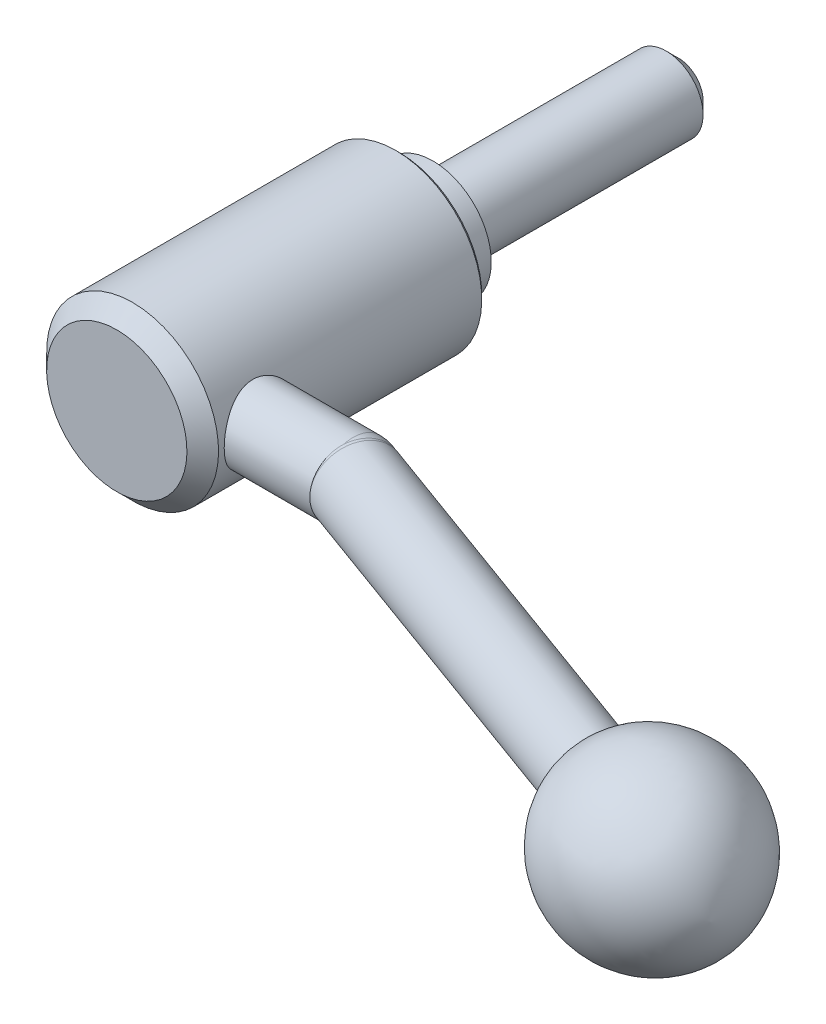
ISO-10303-21;
HEADER;
FILE_DESCRIPTION(('STEP AP214'),'2;1');
FILE_NAME('part.step','',(''),(''),'','','');
FILE_SCHEMA(('AUTOMOTIVE_DESIGN { 1 0 10303 214 1 1 1 1 }'));
ENDSEC;
DATA;
#1=APPLICATION_CONTEXT('core data for automotive mechanical design processes');
#2=APPLICATION_PROTOCOL_DEFINITION('international standard','automotive_design',2000,#1);
#3=PRODUCT_CONTEXT('',#1,'mechanical');
#4=PRODUCT('Part','Part','',(#3));
#5=PRODUCT_RELATED_PRODUCT_CATEGORY('part','',(#4));
#6=PRODUCT_DEFINITION_FORMATION('','',#4);
#7=PRODUCT_DEFINITION_CONTEXT('part definition',#1,'design');
#8=PRODUCT_DEFINITION('design','',#6,#7);
#9=PRODUCT_DEFINITION_SHAPE('','',#8);
#10=(LENGTH_UNIT() NAMED_UNIT(*) SI_UNIT(.MILLI.,.METRE.));
#11=(NAMED_UNIT(*) PLANE_ANGLE_UNIT() SI_UNIT($,.RADIAN.));
#12=(NAMED_UNIT(*) SI_UNIT($,.STERADIAN.) SOLID_ANGLE_UNIT());
#13=UNCERTAINTY_MEASURE_WITH_UNIT(LENGTH_MEASURE(1.E-05),#10,'distance_accuracy_value','');
#14=(GEOMETRIC_REPRESENTATION_CONTEXT(3) GLOBAL_UNCERTAINTY_ASSIGNED_CONTEXT((#13)) GLOBAL_UNIT_ASSIGNED_CONTEXT((#10,
#11,#12)) REPRESENTATION_CONTEXT('',''));
#15=CARTESIAN_POINT('',(0.,0.,0.));
#16=DIRECTION('',(0.,0.,1.));
#17=DIRECTION('',(1.,0.,0.));
#18=AXIS2_PLACEMENT_3D('',#15,#16,#17);
#19=CARTESIAN_POINT('',(0.,0.,0.));
#20=DIRECTION('',(0.,0.,-1.));
#21=DIRECTION('',(0.,1.,0.));
#22=AXIS2_PLACEMENT_3D('',#19,#20,#21);
#23=CYLINDRICAL_SURFACE('',#22,14.);
#24=CARTESIAN_POINT('',(0.,0.,6.05));
#25=DIRECTION('',(0.,0.,-1.));
#26=DIRECTION('',(0.,1.,0.));
#27=AXIS2_PLACEMENT_3D('',#24,#25,#26);
#28=CIRCLE('',#27,14.);
#29=CARTESIAN_POINT('',(0.,14.,6.05));
#30=VERTEX_POINT('',#29);
#31=EDGE_CURVE('E147',#30,#30,#28,.T.);
#32=ORIENTED_EDGE('',*,*,#31,.F.);
#33=EDGE_LOOP('',(#32));
#34=FACE_BOUND('',#33,.T.);
#35=CARTESIAN_POINT('',(12.6491106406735,6.,42.));
#36=CARTESIAN_POINT('',(12.6491119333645,5.99999879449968,42.1596004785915));
#37=CARTESIAN_POINT('',(12.6521417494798,5.99362272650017,42.319252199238));
#38=CARTESIAN_POINT('',(12.6641604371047,5.96818497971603,42.6373858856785));
#39=CARTESIAN_POINT('',(12.6731530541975,5.9491153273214,42.7958670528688));
#40=CARTESIAN_POINT('',(12.6968113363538,5.89845433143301,43.1107250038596));
#41=CARTESIAN_POINT('',(12.7114886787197,5.86683721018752,43.2670967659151));
#42=CARTESIAN_POINT('',(12.7460281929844,5.79141457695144,43.5763457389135));
#43=CARTESIAN_POINT('',(12.7658925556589,5.74760391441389,43.7292214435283));
#44=CARTESIAN_POINT('',(12.8100655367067,5.64846416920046,44.029718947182));
#45=CARTESIAN_POINT('',(12.834352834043,5.59319017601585,44.177362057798));
#46=CARTESIAN_POINT('',(12.8867070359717,5.47148691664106,44.467303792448));
#47=CARTESIAN_POINT('',(12.9147753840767,5.40505338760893,44.6096003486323));
#48=CARTESIAN_POINT('',(13.0034453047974,5.18984372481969,45.0271066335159));
#49=CARTESIAN_POINT('',(13.0685687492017,5.02503655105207,45.2932994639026));
#50=CARTESIAN_POINT('',(13.2082270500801,4.64606142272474,45.8109410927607));
#51=CARTESIAN_POINT('',(13.2830918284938,4.42953098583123,46.0605561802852));
#52=CARTESIAN_POINT('',(13.4311425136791,3.95794082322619,46.5214200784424));
#53=CARTESIAN_POINT('',(13.5043277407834,3.70286580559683,46.7326535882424));
#54=CARTESIAN_POINT('',(13.6088499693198,3.28949768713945,47.0208851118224));
#55=CARTESIAN_POINT('',(13.6435186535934,3.14296205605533,47.11390422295));
#56=CARTESIAN_POINT('',(13.7094062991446,2.84181000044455,47.2871776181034));
#57=CARTESIAN_POINT('',(13.7406265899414,2.68719672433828,47.3674368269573));
#58=CARTESIAN_POINT('',(13.798716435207,2.37092404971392,47.5144478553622));
#59=CARTESIAN_POINT('',(13.8255866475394,2.2092657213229,47.5812017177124));
#60=CARTESIAN_POINT('',(13.8741880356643,1.88004748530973,47.7005320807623));
#61=CARTESIAN_POINT('',(13.895919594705,1.71248801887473,47.7531096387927));
#62=CARTESIAN_POINT('',(13.9325503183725,1.38207962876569,47.8410157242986));
#63=CARTESIAN_POINT('',(13.9477579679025,1.21947370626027,47.8771298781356));
#64=CARTESIAN_POINT('',(13.9725603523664,0.891408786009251,47.9357518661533));
#65=CARTESIAN_POINT('',(13.9821554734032,0.725949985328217,47.9582606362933));
#66=CARTESIAN_POINT('',(13.9954554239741,0.393553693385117,47.9894048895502));
#67=CARTESIAN_POINT('',(13.9991623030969,0.226616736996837,47.9980452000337));
#68=CARTESIAN_POINT('',(14.0005839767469,-0.107418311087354,48.0013627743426));
#69=CARTESIAN_POINT('',(13.9982990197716,-0.274516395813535,47.996040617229));
#70=CARTESIAN_POINT('',(13.9881447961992,-0.596733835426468,47.9722942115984));
#71=CARTESIAN_POINT('',(13.9806457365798,-0.751929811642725,47.9547383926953));
#72=CARTESIAN_POINT('',(13.9606520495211,-1.06021754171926,47.9076442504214));
#73=CARTESIAN_POINT('',(13.9481558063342,-1.21330859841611,47.8781020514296));
#74=CARTESIAN_POINT('',(13.9184825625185,-1.51624558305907,47.807339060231));
#75=CARTESIAN_POINT('',(13.9013071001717,-1.66609256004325,47.7661221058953));
#76=CARTESIAN_POINT('',(13.8626834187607,-1.96169333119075,47.6723729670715));
#77=CARTESIAN_POINT('',(13.8412335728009,-2.10744554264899,47.6198364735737));
#78=CARTESIAN_POINT('',(13.7942200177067,-2.39607632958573,47.5030361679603));
#79=CARTESIAN_POINT('',(13.7685998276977,-2.53887984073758,47.4386094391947));
#80=CARTESIAN_POINT('',(13.7140859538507,-2.81854325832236,47.2990820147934));
#81=CARTESIAN_POINT('',(13.6851910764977,-2.9554009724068,47.2239774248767));
#82=CARTESIAN_POINT('',(13.5945766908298,-3.35592063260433,46.9834369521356));
#83=CARTESIAN_POINT('',(13.5288965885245,-3.60971063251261,46.8027004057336));
#84=CARTESIAN_POINT('',(13.3878711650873,-4.10313412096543,46.3903719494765));
#85=CARTESIAN_POINT('',(13.3121702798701,-4.34033236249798,46.1560074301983));
#86=CARTESIAN_POINT('',(13.1631451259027,-4.77326595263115,45.6505491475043));
#87=CARTESIAN_POINT('',(13.0898218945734,-4.96898340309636,45.3794396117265));
#88=CARTESIAN_POINT('',(12.9865629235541,-5.2305288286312,44.9447706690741));
#89=CARTESIAN_POINT('',(12.9527260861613,-5.31354333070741,44.7922272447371));
#90=CARTESIAN_POINT('',(12.8890027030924,-5.46630143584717,44.4798640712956));
#91=CARTESIAN_POINT('',(12.8591145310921,-5.53605050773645,44.3200473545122));
#92=CARTESIAN_POINT('',(12.8043472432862,-5.66157110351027,43.9942625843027));
#93=CARTESIAN_POINT('',(12.7794661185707,-5.7173482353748,43.8282970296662));
#94=CARTESIAN_POINT('',(12.7356345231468,-5.81433157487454,43.4913958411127));
#95=CARTESIAN_POINT('',(12.7166834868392,-5.85553917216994,43.3204606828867));
#96=CARTESIAN_POINT('',(12.6865220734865,-5.9205872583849,42.9866991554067));
#97=CARTESIAN_POINT('',(12.6748757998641,-5.94541170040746,42.824103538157));
#98=CARTESIAN_POINT('',(12.6578221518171,-5.98163380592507,42.4971025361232));
#99=CARTESIAN_POINT('',(12.6524143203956,-5.99303245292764,42.3326972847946));
#100=CARTESIAN_POINT('',(12.6480404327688,-6.00225784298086,42.0034733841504));
#101=CARTESIAN_POINT('',(12.6490723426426,-6.00008887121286,41.8386548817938));
#102=CARTESIAN_POINT('',(12.6575345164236,-5.98221680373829,41.5099230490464));
#103=CARTESIAN_POINT('',(12.6649645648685,-5.96651416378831,41.3460096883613));
#104=CARTESIAN_POINT('',(12.685211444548,-5.92333782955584,41.0317850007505));
#105=CARTESIAN_POINT('',(12.6976163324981,-5.89676170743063,40.8813224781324));
#106=CARTESIAN_POINT('',(12.7273370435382,-5.83233654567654,40.5832773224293));
#107=CARTESIAN_POINT('',(12.7446544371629,-5.79448390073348,40.435695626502));
#108=CARTESIAN_POINT('',(12.7836779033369,-5.70787446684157,40.1443991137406));
#109=CARTESIAN_POINT('',(12.8053831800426,-5.65911965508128,40.0006836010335));
#110=CARTESIAN_POINT('',(12.8525781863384,-5.55109972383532,39.7178468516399));
#111=CARTESIAN_POINT('',(12.8780693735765,-5.49183055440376,39.5787274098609));
#112=CARTESIAN_POINT('',(12.9333207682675,-5.36045709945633,39.2999549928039));
#113=CARTESIAN_POINT('',(12.9632176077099,-5.28790975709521,39.160537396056));
#114=CARTESIAN_POINT('',(13.0255703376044,-5.13240219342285,38.8882359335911));
#115=CARTESIAN_POINT('',(13.0580270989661,-5.04943842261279,38.7553543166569));
#116=CARTESIAN_POINT('',(13.1580121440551,-4.78560208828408,38.3674196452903));
#117=CARTESIAN_POINT('',(13.2281845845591,-4.58971750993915,38.1229353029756));
#118=CARTESIAN_POINT('',(13.3366249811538,-4.26021445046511,37.7715869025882));
#119=CARTESIAN_POINT('',(13.3748529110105,-4.13892354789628,37.6527973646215));
#120=CARTESIAN_POINT('',(13.4503551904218,-3.88654904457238,37.4257795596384));
#121=CARTESIAN_POINT('',(13.4876298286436,-3.75546845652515,37.3175480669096));
#122=CARTESIAN_POINT('',(13.5602429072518,-3.48418488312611,37.1123202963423));
#123=CARTESIAN_POINT('',(13.5955803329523,-3.34397719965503,37.0153298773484));
#124=CARTESIAN_POINT('',(13.6633349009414,-3.05536185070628,36.8333913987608));
#125=CARTESIAN_POINT('',(13.6957533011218,-2.90695776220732,36.7484381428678));
#126=CARTESIAN_POINT('',(13.7569620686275,-2.60198219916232,36.5908122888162));
#127=CARTESIAN_POINT('',(13.78573175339,-2.44537070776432,36.5182089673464));
#128=CARTESIAN_POINT('',(13.8386034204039,-2.12585519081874,36.3865716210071));
#129=CARTESIAN_POINT('',(13.862707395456,-1.96295388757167,36.3275318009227));
#130=CARTESIAN_POINT('',(13.9055467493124,-1.63205123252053,36.2236281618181));
#131=CARTESIAN_POINT('',(13.9242837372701,-1.46405142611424,36.1787600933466));
#132=CARTESIAN_POINT('',(13.9558282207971,-1.12426022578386,36.1037042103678));
#133=CARTESIAN_POINT('',(13.9686361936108,-0.952469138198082,36.0735152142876));
#134=CARTESIAN_POINT('',(13.9872197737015,-0.619242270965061,36.0298514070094));
#135=CARTESIAN_POINT('',(13.9934418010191,-0.457969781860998,36.0153142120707));
#136=CARTESIAN_POINT('',(14.0002858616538,-0.134661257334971,35.9993285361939));
#137=CARTESIAN_POINT('',(14.0009081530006,0.0273747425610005,35.99787945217));
#138=CARTESIAN_POINT('',(13.9965361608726,0.350926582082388,36.008085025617));
#139=CARTESIAN_POINT('',(13.991542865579,0.512442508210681,36.0197373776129));
#140=CARTESIAN_POINT('',(13.976077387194,0.833743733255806,36.0560107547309));
#141=CARTESIAN_POINT('',(13.9656052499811,0.993529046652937,36.0806316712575));
#142=CARTESIAN_POINT('',(13.9399800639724,1.30393627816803,36.1413509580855));
#143=CARTESIAN_POINT('',(13.9250277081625,1.45467118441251,36.176958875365));
#144=CARTESIAN_POINT('',(13.89068609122,1.75251852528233,36.2595669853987));
#145=CARTESIAN_POINT('',(13.8712953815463,1.89962975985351,36.3065708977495));
#146=CARTESIAN_POINT('',(13.8285434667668,2.18924878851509,36.4115377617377));
#147=CARTESIAN_POINT('',(13.8051831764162,2.33175763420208,36.4694981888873));
#148=CARTESIAN_POINT('',(13.7550167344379,2.61145800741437,36.5959410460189));
#149=CARTESIAN_POINT('',(13.7282092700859,2.74864748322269,36.6644274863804));
#150=CARTESIAN_POINT('',(13.6704759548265,3.02301487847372,36.8147378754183));
#151=CARTESIAN_POINT('',(13.639418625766,3.1599112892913,36.8970251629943));
#152=CARTESIAN_POINT('',(13.5749315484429,3.42637329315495,37.0719801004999));
#153=CARTESIAN_POINT('',(13.5415009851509,3.55593634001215,37.1646513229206));
#154=CARTESIAN_POINT('',(13.4730570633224,3.80705581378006,37.3597829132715));
#155=CARTESIAN_POINT('',(13.4380434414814,3.9286109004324,37.4622449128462));
#156=CARTESIAN_POINT('',(13.3672591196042,4.16309810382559,37.6763643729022));
#157=CARTESIAN_POINT('',(13.3314883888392,4.27602986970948,37.7880222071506));
#158=CARTESIAN_POINT('',(13.257431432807,4.50061025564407,38.02841367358));
#159=CARTESIAN_POINT('',(13.2191519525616,4.61156500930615,38.1577987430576));
#160=CARTESIAN_POINT('',(13.1437838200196,4.82218384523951,38.4257073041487));
#161=CARTESIAN_POINT('',(13.1066947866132,4.92185156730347,38.5642278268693));
#162=CARTESIAN_POINT('',(13.0347422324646,5.10936324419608,38.8498227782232));
#163=CARTESIAN_POINT('',(12.9998810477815,5.19719489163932,38.9969058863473));
#164=CARTESIAN_POINT('',(12.9335248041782,5.36019403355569,39.2985749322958));
#165=CARTESIAN_POINT('',(12.9020282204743,5.43536727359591,39.4531574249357));
#166=CARTESIAN_POINT('',(12.8434648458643,5.57233851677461,39.7687244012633));
#167=CARTESIAN_POINT('',(12.8163926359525,5.63415291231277,39.9297007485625));
#168=CARTESIAN_POINT('',(12.7676047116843,5.74385568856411,40.2570433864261));
#169=CARTESIAN_POINT('',(12.7458863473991,5.79175096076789,40.4234069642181));
#170=CARTESIAN_POINT('',(12.7086612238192,5.87298255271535,40.7598587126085));
#171=CARTESIAN_POINT('',(12.6931381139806,5.90635721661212,40.9299358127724));
#172=CARTESIAN_POINT('',(12.6688496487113,5.95827833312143,41.2727263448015));
#173=CARTESIAN_POINT('',(12.6600791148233,5.97683614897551,41.4454376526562));
#174=CARTESIAN_POINT('',(12.6529445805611,5.99191158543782,41.6821226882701));
#175=CARTESIAN_POINT('',(12.6515079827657,5.99494373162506,41.7456483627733));
#176=CARTESIAN_POINT('',(12.6495907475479,5.998988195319,41.8727799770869));
#177=CARTESIAN_POINT('',(12.6491101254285,6.00000048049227,41.936385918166));
#178=CARTESIAN_POINT('',(12.6491106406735,6.,42.));
#179=B_SPLINE_CURVE_WITH_KNOTS('',3,(#35,#36,#37,#38,#39,#40,#41,#42,#43,#44,#45,#46,#47,#48,
#49,#50,#51,#52,#53,#54,#55,#56,#57,#58,#59,#60,#61,#62,#63,#64,#65,#66,#67,#68,#69,#70,#71,#72,
#73,#74,#75,#76,#77,#78,#79,#80,#81,#82,#83,#84,#85,#86,#87,#88,#89,#90,#91,#92,#93,#94,#95,#96,
#97,#98,#99,#100,#101,#102,#103,#104,#105,#106,#107,#108,#109,#110,#111,#112,#113,#114,#115,
#116,#117,#118,#119,#120,#121,#122,#123,#124,#125,#126,#127,#128,#129,#130,#131,#132,#133,#134,
#135,#136,#137,#138,#139,#140,#141,#142,#143,#144,#145,#146,#147,#148,#149,#150,#151,#152,#153,
#154,#155,#156,#157,#158,#159,#160,#161,#162,#163,#164,#165,#166,#167,#168,#169,#170,#171,#172,
#173,#174,#175,#176,#177,#178),.UNSPECIFIED.,.T.,.F.,(4,2,2,2,2,2,2,2,2,2,2,2,2,2,2,2,2,2,2,2,2,
2,2,2,2,2,2,2,2,2,2,2,2,2,2,2,2,2,2,2,2,2,2,2,2,2,2,2,2,2,2,2,2,2,2,2,2,2,2,2,2,2,2,2,2,2,2,2,2,
2,2,4),(0.,0.478735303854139,0.957771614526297,1.43779720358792,1.91802586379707,
2.39599804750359,2.87415322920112,3.82930565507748,4.84157827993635,5.85425356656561,
6.38467511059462,6.91489143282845,7.44502749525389,7.97512400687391,8.47625092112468,
8.9773433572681,9.47826133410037,9.97915853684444,10.4477041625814,10.9164014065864,
11.3849447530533,11.8536667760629,12.3293655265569,12.8052382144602,13.756394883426,
14.7778987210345,15.7998424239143,16.330075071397,16.8600886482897,17.3898891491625,
17.9196391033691,18.4136567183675,18.9076381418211,19.4014635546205,19.8952723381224,
20.354632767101,20.814140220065,21.2735644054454,21.7331659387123,22.2125740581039,
22.6921459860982,23.6508169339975,24.1724207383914,24.6938646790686,25.2155791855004,
25.7370677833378,26.2613915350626,26.7854908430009,27.3094328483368,27.8333326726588,
28.3188546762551,28.8043543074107,29.2897685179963,29.7751786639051,30.2414628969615,
30.7078995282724,31.1742288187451,31.6407362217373,32.1283561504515,32.6161443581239,
33.1040139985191,33.5919034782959,34.1153644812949,34.6386561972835,35.1624879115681,
35.6860812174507,36.2090283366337,36.7317160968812,37.253015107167,37.7739139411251,
37.9647267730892,38.1555426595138),.UNSPECIFIED.);
#180=CARTESIAN_POINT('',(12.6491106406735,6.,42.));
#181=VERTEX_POINT('',#180);
#182=EDGE_CURVE('E77',#181,#181,#179,.T.);
#183=ORIENTED_EDGE('',*,*,#182,.F.);
#184=EDGE_LOOP('',(#183));
#185=FACE_BOUND('',#184,.T.);
#186=CARTESIAN_POINT('',(0.,0.,48.925));
#187=DIRECTION('',(0.,0.,-1.));
#188=DIRECTION('',(0.,1.,0.));
#189=AXIS2_PLACEMENT_3D('',#186,#187,#188);
#190=CIRCLE('',#189,14.);
#191=CARTESIAN_POINT('',(0.,14.,48.925));
#192=VERTEX_POINT('',#191);
#193=EDGE_CURVE('E149',#192,#192,#190,.T.);
#194=ORIENTED_EDGE('',*,*,#193,.T.);
#195=EDGE_LOOP('',(#194));
#196=FACE_BOUND('',#195,.T.);
#197=ADVANCED_FACE('F14',(#34,#185,#196),#23,.T.);
#198=CARTESIAN_POINT('',(0.,0.,51.5));
#199=DIRECTION('',(0.,0.,-1.));
#200=DIRECTION('',(0.,1.,0.));
#201=AXIS2_PLACEMENT_3D('',#198,#199,#200);
#202=PLANE('',#201);
#203=CARTESIAN_POINT('',(0.,0.,51.5));
#204=DIRECTION('',(0.,0.,-1.));
#205=DIRECTION('',(0.,1.,0.));
#206=AXIS2_PLACEMENT_3D('',#203,#204,#205);
#207=CIRCLE('',#206,11.425);
#208=CARTESIAN_POINT('',(0.,11.425,51.5));
#209=VERTEX_POINT('',#208);
#210=EDGE_CURVE('E85',#209,#209,#207,.T.);
#211=ORIENTED_EDGE('',*,*,#210,.F.);
#212=EDGE_LOOP('',(#211));
#213=FACE_BOUND('',#212,.T.);
#214=ADVANCED_FACE('F61',(#213),#202,.F.);
#215=CARTESIAN_POINT('',(0.,0.,51.5));
#216=DIRECTION('',(0.,0.,-1.));
#217=DIRECTION('',(0.,1.,0.));
#218=AXIS2_PLACEMENT_3D('',#215,#216,#217);
#219=CONICAL_SURFACE('',#218,11.425,0.785398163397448);
#220=ORIENTED_EDGE('',*,*,#193,.F.);
#221=EDGE_LOOP('',(#220));
#222=FACE_BOUND('',#221,.T.);
#223=ORIENTED_EDGE('',*,*,#210,.T.);
#224=EDGE_LOOP('',(#223));
#225=FACE_BOUND('',#224,.T.);
#226=ADVANCED_FACE('F67',(#222,#225),#219,.T.);
#227=CARTESIAN_POINT('',(0.,0.,6.05));
#228=DIRECTION('',(0.,0.,1.));
#229=DIRECTION('',(0.,-1.,0.));
#230=AXIS2_PLACEMENT_3D('',#227,#228,#229);
#231=CONICAL_SURFACE('',#230,14.,0.785398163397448);
#232=CARTESIAN_POINT('',(0.,0.,5.5));
#233=DIRECTION('',(0.,0.,-1.));
#234=DIRECTION('',(0.,1.,0.));
#235=AXIS2_PLACEMENT_3D('',#232,#233,#234);
#236=CIRCLE('',#235,13.45);
#237=CARTESIAN_POINT('',(0.,13.45,5.5));
#238=VERTEX_POINT('',#237);
#239=EDGE_CURVE('E142',#238,#238,#236,.T.);
#240=ORIENTED_EDGE('',*,*,#239,.F.);
#241=EDGE_LOOP('',(#240));
#242=FACE_BOUND('',#241,.T.);
#243=ORIENTED_EDGE('',*,*,#31,.T.);
#244=EDGE_LOOP('',(#243));
#245=FACE_BOUND('',#244,.T.);
#246=ADVANCED_FACE('F74',(#242,#245),#231,.T.);
#247=CARTESIAN_POINT('',(13.45,0.,5.5));
#248=DIRECTION('',(0.,0.,1.));
#249=DIRECTION('',(0.,-1.,0.));
#250=AXIS2_PLACEMENT_3D('',#247,#248,#249);
#251=PLANE('',#250);
#252=CARTESIAN_POINT('',(0.,0.,5.5));
#253=DIRECTION('',(0.,0.,-1.));
#254=DIRECTION('',(0.,1.,0.));
#255=AXIS2_PLACEMENT_3D('',#252,#253,#254);
#256=CIRCLE('',#255,9.5);
#257=CARTESIAN_POINT('',(0.,9.5,5.5));
#258=VERTEX_POINT('',#257);
#259=EDGE_CURVE('E140',#258,#258,#256,.T.);
#260=ORIENTED_EDGE('',*,*,#259,.F.);
#261=EDGE_LOOP('',(#260));
#262=FACE_BOUND('',#261,.T.);
#263=ORIENTED_EDGE('',*,*,#239,.T.);
#264=EDGE_LOOP('',(#263));
#265=FACE_BOUND('',#264,.T.);
#266=ADVANCED_FACE('F161',(#262,#265),#251,.F.);
#267=CARTESIAN_POINT('',(0.,0.,0.));
#268=DIRECTION('',(0.,0.,-1.));
#269=DIRECTION('',(0.,1.,0.));
#270=AXIS2_PLACEMENT_3D('',#267,#268,#269);
#271=CYLINDRICAL_SURFACE('',#270,9.5);
#272=CARTESIAN_POINT('',(0.,0.,0.));
#273=DIRECTION('',(0.,0.,-1.));
#274=DIRECTION('',(0.,1.,0.));
#275=AXIS2_PLACEMENT_3D('',#272,#273,#274);
#276=CIRCLE('',#275,9.5);
#277=CARTESIAN_POINT('',(0.,9.5,0.));
#278=VERTEX_POINT('',#277);
#279=EDGE_CURVE('E138',#278,#278,#276,.T.);
#280=ORIENTED_EDGE('',*,*,#279,.F.);
#281=EDGE_LOOP('',(#280));
#282=FACE_BOUND('',#281,.T.);
#283=ORIENTED_EDGE('',*,*,#259,.T.);
#284=EDGE_LOOP('',(#283));
#285=FACE_BOUND('',#284,.T.);
#286=ADVANCED_FACE('F135',(#282,#285),#271,.T.);
#287=CARTESIAN_POINT('',(9.5,0.,0.));
#288=DIRECTION('',(0.,0.,1.));
#289=DIRECTION('',(0.,-1.,0.));
#290=AXIS2_PLACEMENT_3D('',#287,#288,#289);
#291=PLANE('',#290);
#292=CARTESIAN_POINT('',(0.,0.,0.));
#293=DIRECTION('',(0.,0.,-1.));
#294=DIRECTION('',(0.,1.,0.));
#295=AXIS2_PLACEMENT_3D('',#292,#293,#294);
#296=CIRCLE('',#295,6.);
#297=CARTESIAN_POINT('',(0.,6.,0.));
#298=VERTEX_POINT('',#297);
#299=EDGE_CURVE('E126',#298,#298,#296,.T.);
#300=ORIENTED_EDGE('',*,*,#299,.F.);
#301=EDGE_LOOP('',(#300));
#302=FACE_BOUND('',#301,.T.);
#303=ORIENTED_EDGE('',*,*,#279,.T.);
#304=EDGE_LOOP('',(#303));
#305=FACE_BOUND('',#304,.T.);
#306=ADVANCED_FACE('F93',(#302,#305),#291,.F.);
#307=CARTESIAN_POINT('',(35.,0.,42.));
#308=DIRECTION('',(1.,0.,0.));
#309=DIRECTION('',(0.,1.,0.));
#310=AXIS2_PLACEMENT_3D('',#307,#308,#309);
#311=CYLINDRICAL_SURFACE('',#310,6.);
#312=CARTESIAN_POINT('',(29.0002,-5.79737991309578,43.546087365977));
#313=CARTESIAN_POINT('',(28.9724990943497,-5.77707543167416,43.6222362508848));
#314=CARTESIAN_POINT('',(28.9459271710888,-5.75516638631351,43.6983487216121));
#315=CARTESIAN_POINT('',(28.894739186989,-5.70814835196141,43.8502306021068));
#316=CARTESIAN_POINT('',(28.8701228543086,-5.68303980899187,43.9260000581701));
#317=CARTESIAN_POINT('',(28.7987695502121,-5.6029491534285,44.1523368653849));
#318=CARTESIAN_POINT('',(28.7544982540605,-5.54317949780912,44.3020176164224));
#319=CARTESIAN_POINT('',(28.6711793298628,-5.41121602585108,44.5970862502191));
#320=CARTESIAN_POINT('',(28.6321268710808,-5.3390338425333,44.7424780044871));
#321=CARTESIAN_POINT('',(28.5583361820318,-5.18257721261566,45.0277646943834));
#322=CARTESIAN_POINT('',(28.5235982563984,-5.09830191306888,45.1676592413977));
#323=CARTESIAN_POINT('',(28.4579073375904,-4.91822874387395,45.4406017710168));
#324=CARTESIAN_POINT('',(28.4269515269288,-4.82243955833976,45.5736548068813));
#325=CARTESIAN_POINT('',(28.3684157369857,-4.61988344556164,45.8319198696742));
#326=CARTESIAN_POINT('',(28.3408357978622,-4.5131163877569,45.9571318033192));
#327=CARTESIAN_POINT('',(28.2887910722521,-4.28931411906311,46.1986769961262));
#328=CARTESIAN_POINT('',(28.264325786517,-4.17228055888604,46.3150116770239));
#329=CARTESIAN_POINT('',(28.2183149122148,-3.92870690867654,46.537897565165));
#330=CARTESIAN_POINT('',(28.1967693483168,-3.8021667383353,46.6444486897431));
#331=CARTESIAN_POINT('',(28.1562496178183,-3.53907309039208,46.8479799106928));
#332=CARTESIAN_POINT('',(28.1373045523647,-3.40242909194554,46.944848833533));
#333=CARTESIAN_POINT('',(28.1021430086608,-3.12121919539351,47.1269937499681));
#334=CARTESIAN_POINT('',(28.0859274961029,-2.97665051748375,47.212265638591));
#335=CARTESIAN_POINT('',(28.0561585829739,-2.68068805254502,47.3704807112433));
#336=CARTESIAN_POINT('',(28.0426047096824,-2.52929548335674,47.4434260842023));
#337=CARTESIAN_POINT('',(28.0180943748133,-2.2206886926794,47.5764491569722));
#338=CARTESIAN_POINT('',(28.0071388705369,-2.063472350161,47.6365221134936));
#339=CARTESIAN_POINT('',(27.987872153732,-1.74574860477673,47.7428380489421));
#340=CARTESIAN_POINT('',(27.97953948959,-1.5852799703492,47.7891930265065));
#341=CARTESIAN_POINT('',(27.965363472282,-1.26087148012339,47.8683977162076));
#342=CARTESIAN_POINT('',(27.9595210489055,-1.09693035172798,47.9012423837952));
#343=CARTESIAN_POINT('',(27.950314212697,-0.766902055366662,47.9531293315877));
#344=CARTESIAN_POINT('',(27.9469484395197,-0.600816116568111,47.972179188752));
#345=CARTESIAN_POINT('',(27.9426785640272,-0.267526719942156,47.9963621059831));
#346=CARTESIAN_POINT('',(27.9417755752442,-0.100322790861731,48.0014888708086));
#347=CARTESIAN_POINT('',(27.9424301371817,0.233076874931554,47.9977768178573));
#348=CARTESIAN_POINT('',(27.943975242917,0.399273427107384,47.9890086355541));
#349=CARTESIAN_POINT('',(27.9495060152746,0.730248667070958,47.9577139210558));
#350=CARTESIAN_POINT('',(27.9534905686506,0.895027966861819,47.9351936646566));
#351=CARTESIAN_POINT('',(27.9639138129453,1.22215531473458,47.8765604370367));
#352=CARTESIAN_POINT('',(27.9703537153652,1.38450212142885,47.8404407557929));
#353=CARTESIAN_POINT('',(27.9857050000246,1.70547020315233,47.7549062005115));
#354=CARTESIAN_POINT('',(27.9946154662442,1.86409283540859,47.7054962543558));
#355=CARTESIAN_POINT('',(28.0149428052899,2.17661167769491,47.5937385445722));
#356=CARTESIAN_POINT('',(28.0263605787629,2.33050616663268,47.5313861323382));
#357=CARTESIAN_POINT('',(28.0517386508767,2.63237333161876,47.3942638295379));
#358=CARTESIAN_POINT('',(28.0656980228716,2.78034814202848,47.3194984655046));
#359=CARTESIAN_POINT('',(28.0962237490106,3.06943625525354,47.1580977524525));
#360=CARTESIAN_POINT('',(28.1127906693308,3.21054805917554,47.0714598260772));
#361=CARTESIAN_POINT('',(28.1486024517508,3.48485557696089,46.8870325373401));
#362=CARTESIAN_POINT('',(28.1678464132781,3.61805393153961,46.789246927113));
#363=CARTESIAN_POINT('',(28.2092310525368,3.87634885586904,46.5827287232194));
#364=CARTESIAN_POINT('',(28.2313862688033,4.00139970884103,46.4739418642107));
#365=CARTESIAN_POINT('',(28.2786635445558,4.24179144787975,46.2467117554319));
#366=CARTESIAN_POINT('',(28.303785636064,4.35713222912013,46.128268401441));
#367=CARTESIAN_POINT('',(28.3572036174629,4.57734862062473,45.8826648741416));
#368=CARTESIAN_POINT('',(28.38549985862,4.68222307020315,45.7555037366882));
#369=CARTESIAN_POINT('',(28.445549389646,4.88081288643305,45.4935198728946));
#370=CARTESIAN_POINT('',(28.4773025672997,4.97452861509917,45.3586973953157));
#371=CARTESIAN_POINT('',(28.5429262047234,5.14565563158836,45.0897088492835));
#372=CARTESIAN_POINT('',(28.5766009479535,5.22366104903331,44.9558726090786));
#373=CARTESIAN_POINT('',(28.647938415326,5.36870734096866,44.6834298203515));
#374=CARTESIAN_POINT('',(28.6856006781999,5.43574948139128,44.5448238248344));
#375=CARTESIAN_POINT('',(28.7657142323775,5.55859867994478,44.2639502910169));
#376=CARTESIAN_POINT('',(28.8081677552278,5.61440046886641,44.1216810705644));
#377=CARTESIAN_POINT('',(28.8763731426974,5.68948565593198,43.9067054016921));
#378=CARTESIAN_POINT('',(28.8998696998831,5.7130832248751,43.8347644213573));
#379=CARTESIAN_POINT('',(28.9486375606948,5.7573957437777,43.6905883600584));
#380=CARTESIAN_POINT('',(28.9739090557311,5.77811038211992,43.6183532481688));
#381=CARTESIAN_POINT('',(29.0001999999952,5.79737991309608,43.546087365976));
#382=B_SPLINE_CURVE_WITH_KNOTS('',3,(#312,#313,#314,#315,#316,#317,#318,#319,#320,#321,#322,
#323,#324,#325,#326,#327,#328,#329,#330,#331,#332,#333,#334,#335,#336,#337,#338,#339,#340,#341,
#342,#343,#344,#345,#346,#347,#348,#349,#350,#351,#352,#353,#354,#355,#356,#357,#358,#359,#360,
#361,#362,#363,#364,#365,#366,#367,#368,#369,#370,#371,#372,#373,#374,#375,#376,#377,#378,#379,
#380,#381),.UNSPECIFIED.,.F.,.F.,(4,2,2,2,2,2,2,2,2,2,2,2,2,2,2,2,2,2,2,2,2,2,2,2,2,2,2,2,2,2,2,
2,2,2,4),(0.,0.250554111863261,0.501073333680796,1.00183412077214,1.50212812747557,
2.0024574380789,2.50241172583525,3.00237196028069,3.50225195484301,4.00213617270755,
4.50722386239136,5.01248987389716,5.51766606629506,6.02302808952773,6.52414248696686,
7.02544382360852,7.52646960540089,8.02772188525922,8.52643419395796,9.02491908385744,
9.52365025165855,10.0221967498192,10.5209226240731,11.0194670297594,11.5181198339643,
12.0166052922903,12.5176821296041,13.0187643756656,13.5199021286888,14.0210236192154,
14.4961092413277,14.9711399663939,15.4463928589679,15.684153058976,15.9219389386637),.UNSPECIFIED.);
#383=CARTESIAN_POINT('',(29.,-5.79723335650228,43.5466368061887));
#384=VERTEX_POINT('',#383);
#385=CARTESIAN_POINT('',(27.9420381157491,0.,48.));
#386=VERTEX_POINT('',#385);
#387=EDGE_CURVE('E29',#384,#386,#382,.T.);
#388=ORIENTED_EDGE('',*,*,#387,.T.);
#389=CARTESIAN_POINT('',(29.,5.79723335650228,43.5466368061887));
#390=VERTEX_POINT('',#389);
#391=EDGE_CURVE('E98',#386,#390,#382,.T.);
#392=ORIENTED_EDGE('',*,*,#391,.T.);
#393=CARTESIAN_POINT('',(29.,0.,42.));
#394=DIRECTION('',(1.,0.,0.));
#395=DIRECTION('',(0.,1.,0.));
#396=AXIS2_PLACEMENT_3D('',#393,#394,#395);
#397=CIRCLE('',#396,6.);
#398=EDGE_CURVE('E107',#384,#390,#397,.T.);
#399=ORIENTED_EDGE('',*,*,#398,.F.);
#400=EDGE_LOOP('',(#388,#392,#399));
#401=FACE_BOUND('',#400,.T.);
#402=ORIENTED_EDGE('',*,*,#182,.T.);
#403=EDGE_LOOP('',(#402));
#404=FACE_BOUND('',#403,.T.);
#405=ADVANCED_FACE('F87',(#401,#404),#311,.T.);
#406=CARTESIAN_POINT('',(29.,0.,42.));
#407=DIRECTION('',(1.,0.,0.));
#408=DIRECTION('',(0.,0.,1.));
#409=AXIS2_PLACEMENT_3D('',#406,#407,#408);
#410=SPHERICAL_SURFACE('',#409,6.);
#411=CARTESIAN_POINT('',(29.4970794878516,0.,42.1809221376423));
#412=DIRECTION('',(0.939692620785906,0.,0.342020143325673));
#413=DIRECTION('',(-0.342020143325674,0.,0.939692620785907));
#414=AXIS2_PLACEMENT_3D('',#411,#412,#413);
#415=CIRCLE('',#414,5.97663610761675);
#416=EDGE_CURVE('E36',#384,#390,#415,.T.);
#417=ORIENTED_EDGE('',*,*,#416,.F.);
#418=ORIENTED_EDGE('',*,*,#398,.T.);
#419=EDGE_LOOP('',(#417,#418));
#420=FACE_BOUND('',#419,.T.);
#421=ADVANCED_FACE('F92',(#420),#410,.T.);
#422=CARTESIAN_POINT('',(29.9941589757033,0.,42.3618442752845));
#423=DIRECTION('',(0.939692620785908,0.,0.342020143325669));
#424=DIRECTION('',(-0.342020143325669,0.,0.939692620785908));
#425=AXIS2_PLACEMENT_3D('',#422,#423,#424);
#426=SPHERICAL_SURFACE('',#425,6.);
#427=ORIENTED_EDGE('',*,*,#387,.F.);
#428=ORIENTED_EDGE('',*,*,#416,.T.);
#429=ORIENTED_EDGE('',*,*,#391,.F.);
#430=CARTESIAN_POINT('',(29.9941589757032,0.,42.3618442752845));
#431=DIRECTION('',(0.939692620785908,0.,0.342020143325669));
#432=DIRECTION('',(-0.342020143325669,0.,0.939692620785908));
#433=AXIS2_PLACEMENT_3D('',#430,#431,#432);
#434=CIRCLE('',#433,6.);
#435=EDGE_CURVE('E105',#386,#386,#434,.T.);
#436=ORIENTED_EDGE('',*,*,#435,.F.);
#437=EDGE_LOOP('',(#427,#428,#429,#436));
#438=FACE_BOUND('',#437,.T.);
#439=ADVANCED_FACE('F109',(#438),#426,.T.);
#440=CARTESIAN_POINT('',(120.484247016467,0.,75.2975428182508));
#441=DIRECTION('',(0.939692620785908,0.,0.342020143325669));
#442=DIRECTION('',(-0.342020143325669,0.,0.939692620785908));
#443=AXIS2_PLACEMENT_3D('',#440,#441,#442);
#444=CYLINDRICAL_SURFACE('',#443,6.);
#445=CARTESIAN_POINT('',(93.4815813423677,0.,65.4693762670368));
#446=DIRECTION('',(0.939692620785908,0.,0.342020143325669));
#447=DIRECTION('',(-0.342020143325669,0.,0.939692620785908));
#448=AXIS2_PLACEMENT_3D('',#445,#446,#447);
#449=CIRCLE('',#448,6.);
#450=CARTESIAN_POINT('',(91.4294604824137,0.,71.1075319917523));
#451=VERTEX_POINT('',#450);
#452=EDGE_CURVE('E121',#451,#451,#449,.T.);
#453=ORIENTED_EDGE('',*,*,#452,.F.);
#454=EDGE_LOOP('',(#453));
#455=FACE_BOUND('',#454,.T.);
#456=ORIENTED_EDGE('',*,*,#435,.T.);
#457=EDGE_LOOP('',(#456));
#458=FACE_BOUND('',#457,.T.);
#459=ADVANCED_FACE('F56',(#455,#458),#444,.T.);
#460=CARTESIAN_POINT('',(91.4294604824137,0.,71.1075319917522));
#461=DIRECTION('',(0.939692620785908,0.,0.342020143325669));
#462=DIRECTION('',(-0.342020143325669,0.,0.939692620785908));
#463=AXIS2_PLACEMENT_3D('',#460,#461,#462);
#464=PLANE('',#463);
#465=CARTESIAN_POINT('',(93.4815813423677,0.,65.4693762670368));
#466=DIRECTION('',(0.939692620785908,0.,0.342020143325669));
#467=DIRECTION('',(-0.342020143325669,0.,0.939692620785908));
#468=AXIS2_PLACEMENT_3D('',#465,#466,#467);
#469=CIRCLE('',#468,8.16630341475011);
#470=CARTESIAN_POINT('',(90.688541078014,0.,73.1431913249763));
#471=VERTEX_POINT('',#470);
#472=EDGE_CURVE('E124',#471,#471,#469,.T.);
#473=ORIENTED_EDGE('',*,*,#472,.F.);
#474=EDGE_LOOP('',(#473));
#475=FACE_BOUND('',#474,.T.);
#476=ORIENTED_EDGE('',*,*,#452,.T.);
#477=EDGE_LOOP('',(#476));
#478=FACE_BOUND('',#477,.T.);
#479=ADVANCED_FACE('F45',(#475,#478),#464,.F.);
#480=CARTESIAN_POINT('',(106.,0.,68.5));
#481=DIRECTION('',(0.,0.999999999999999,0.));
#482=DIRECTION('',(-0.342020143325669,0.,0.939692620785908));
#483=AXIS2_PLACEMENT_3D('',#480,#481,#482);
#484=CIRCLE('',#483,16.);
#485=TRIMMED_CURVE('',#484,(PARAMETER_VALUE(-1.48106994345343)),
(PARAMETER_VALUE(1.48106994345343)),.T.,.PARAMETER.);
#486=CARTESIAN_POINT('',(105.509646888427,0.,69.8472341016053));
#487=DIRECTION('',(0.939692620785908,0.,0.342020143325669));
#488=AXIS1_PLACEMENT('',#486,#487);
#489=SURFACE_OF_REVOLUTION('',#485,#488);
#490=ORIENTED_EDGE('',*,*,#472,.T.);
#491=EDGE_LOOP('',(#490));
#492=FACE_BOUND('',#491,.T.);
#493=CARTESIAN_POINT('',(120.484247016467,0.,75.2975428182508));
#494=VERTEX_POINT('',#493);
#495=VERTEX_LOOP('',#494);
#496=FACE_BOUND('',#495,.T.);
#497=ADVANCED_FACE('F42',(#492,#496),#489,.T.);
#498=CARTESIAN_POINT('',(0.,0.,17.));
#499=DIRECTION('',(0.,0.,-1.));
#500=DIRECTION('',(-1.,0.,0.));
#501=AXIS2_PLACEMENT_3D('',#498,#499,#500);
#502=CYLINDRICAL_SURFACE('',#501,6.);
#503=CARTESIAN_POINT('',(0.,0.,-38.));
#504=DIRECTION('',(0.,0.,-1.));
#505=DIRECTION('',(-1.,0.,0.));
#506=AXIS2_PLACEMENT_3D('',#503,#504,#505);
#507=CIRCLE('',#506,6.);
#508=CARTESIAN_POINT('',(-6.,0.,-38.));
#509=VERTEX_POINT('',#508);
#510=EDGE_CURVE('E9',#509,#509,#507,.F.);
#511=ORIENTED_EDGE('',*,*,#510,.T.);
#512=EDGE_LOOP('',(#511));
#513=FACE_BOUND('',#512,.T.);
#514=ORIENTED_EDGE('',*,*,#299,.T.);
#515=EDGE_LOOP('',(#514));
#516=FACE_BOUND('',#515,.T.);
#517=ADVANCED_FACE('F44',(#513,#516),#502,.T.);
#518=CARTESIAN_POINT('',(0.,0.,-40.));
#519=DIRECTION('',(0.,0.,-1.));
#520=DIRECTION('',(-1.,0.,0.));
#521=AXIS2_PLACEMENT_3D('',#518,#519,#520);
#522=PLANE('',#521);
#523=CARTESIAN_POINT('',(0.,0.,-40.));
#524=DIRECTION('',(0.,0.,-1.));
#525=DIRECTION('',(-1.,0.,0.));
#526=AXIS2_PLACEMENT_3D('',#523,#524,#525);
#527=CIRCLE('',#526,4.);
#528=CARTESIAN_POINT('',(-4.,0.,-40.));
#529=VERTEX_POINT('',#528);
#530=EDGE_CURVE('E22',#529,#529,#527,.T.);
#531=ORIENTED_EDGE('',*,*,#530,.T.);
#532=EDGE_LOOP('',(#531));
#533=FACE_BOUND('',#532,.T.);
#534=ADVANCED_FACE('F53',(#533),#522,.T.);
#535=CARTESIAN_POINT('',(0.,0.,-40.));
#536=DIRECTION('',(0.,0.,1.));
#537=DIRECTION('',(1.,0.,0.));
#538=AXIS2_PLACEMENT_3D('',#535,#536,#537);
#539=CONICAL_SURFACE('',#538,4.,0.785398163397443);
#540=ORIENTED_EDGE('',*,*,#510,.F.);
#541=EDGE_LOOP('',(#540));
#542=FACE_BOUND('',#541,.T.);
#543=ORIENTED_EDGE('',*,*,#530,.F.);
#544=EDGE_LOOP('',(#543));
#545=FACE_BOUND('',#544,.T.);
#546=ADVANCED_FACE('F16',(#542,#545),#539,.T.);
#547=CLOSED_SHELL('',(#197,#214,#226,#246,#266,#286,#306,#405,#421,#439,#459,#479,#497,#517,
#534,#546));
#548=MANIFOLD_SOLID_BREP('B1',#547);
#549=ADVANCED_BREP_SHAPE_REPRESENTATION('',(#18,#548),#14);
#550=SHAPE_DEFINITION_REPRESENTATION(#9,#549);
ENDSEC;
END-ISO-10303-21;
